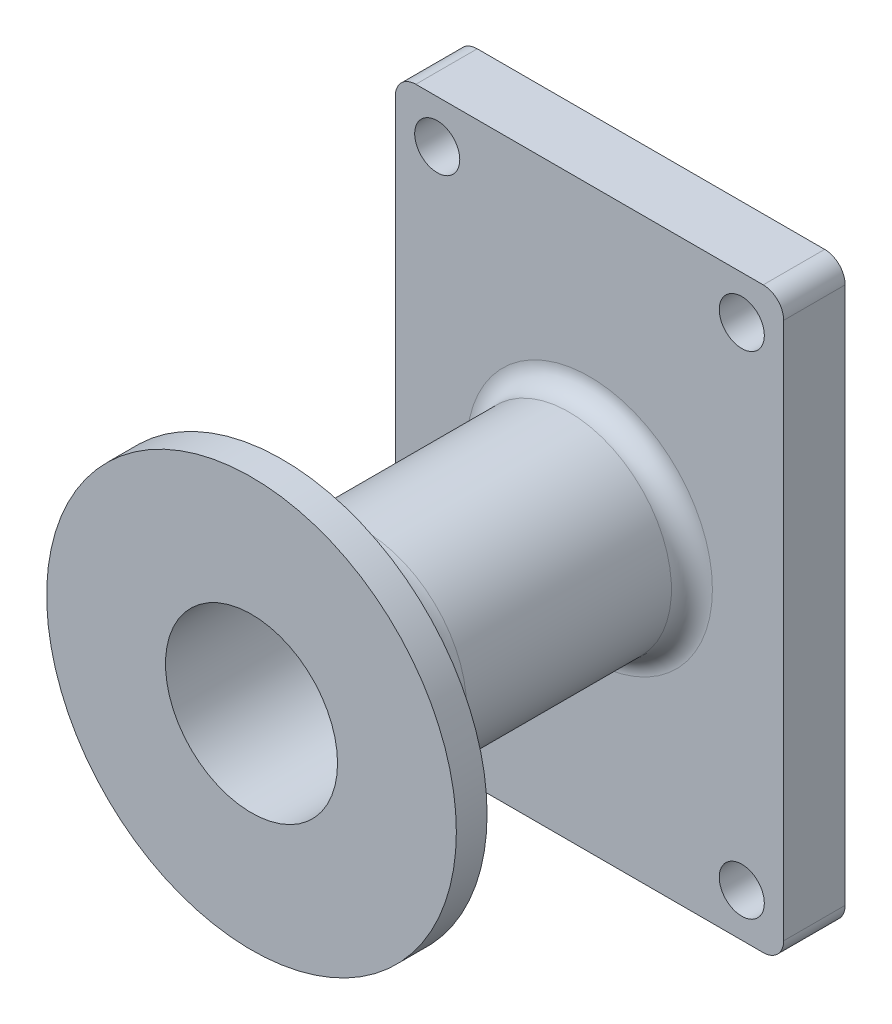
from build123d import *

# Parameters (mm, degrees)
SKETCH1_R           = 1.1
SKETCH1_R_2         = 4.2
BOSS_EXTRUDE1_DEPTH = 3
SKETCH2_R           = 5
SKETCH2_R_2         = 4.2
BOSS_EXTRUDE2_DEPTH = 15
SKETCH3_R           = 7
SKETCH3_R_2         = 4.2
BOSS_EXTRUDE3_DEPTH = 1.5
BOSS_EXTRUDE4_START = -1.5
SKETCH5_R           = 10
SKETCH5_R_2         = 4.2
BOSS_EXTRUDE4_DEPTH = 1.5
FILLET2_R           = 4
FILLET3_R           = 1


with BuildPart() as part:
    # Sketch1 → Boss-Extrude1 (new body)
    with BuildSketch(Plane.XY):
        with BuildLine():
            Line((-235.822109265, -297.144190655), (-218.862203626, -297.144190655))
            ThreePointArc((-218.862203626, -297.144190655), (-218.155096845, -296.851297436), (-217.862203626, -296.144190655))
            Line((-217.862203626, -296.144190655), (-217.862203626, -269.913133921))
            ThreePointArc((-217.862203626, -269.913133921), (-218.155096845, -269.20602714), (-218.862203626, -268.913133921))
            Line((-218.862203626, -268.913133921), (-235.822109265, -268.913133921))
            ThreePointArc((-235.822109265, -268.913133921), (-236.529216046, -269.20602714), (-236.822109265, -269.913133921))
            Line((-236.822109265, -269.913133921), (-236.822109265, -296.144190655))
            ThreePointArc((-236.822109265, -296.144190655), (-236.529216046, -296.851297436), (-235.822109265, -297.144190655))
        make_face()
        with Locations((-219.908436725, -271.028662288)):
            Circle(SKETCH1_R, mode=Mode.SUBTRACT)
        with Locations((-219.908436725, -295.028662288)):
            Circle(SKETCH1_R, mode=Mode.SUBTRACT)
        with Locations((-234.775876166, -295.028662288)):
            Circle(SKETCH1_R, mode=Mode.SUBTRACT)
        with Locations((-234.775876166, -271.028662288)):
            Circle(SKETCH1_R, mode=Mode.SUBTRACT)
        with Locations((-227.342156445, -283.028662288)):
            Circle(SKETCH1_R_2, mode=Mode.SUBTRACT)
    extrude(amount=BOSS_EXTRUDE1_DEPTH)

    # Sketch2 → Boss-Extrude2 (add)
    with BuildSketch(Plane.XY.offset(3)):
        with Locations(Location((-227.342156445, -283.028662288, 0), (0, 0, 180))):
            Circle(SKETCH2_R)
        with Locations((-227.342156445, -283.028662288)):
            Circle(SKETCH2_R_2, mode=Mode.SUBTRACT)
    extrude(amount=BOSS_EXTRUDE2_DEPTH)

    # Sketch3 → Boss-Extrude3 (add)
    with BuildSketch(Plane.XY.offset(18)):
        with Locations((-227.342156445, -283.028662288)):
            Circle(SKETCH3_R)
        with Locations((-227.342156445, -283.028662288)):
            Circle(SKETCH3_R_2, mode=Mode.SUBTRACT)
    extrude(amount=BOSS_EXTRUDE3_DEPTH)

    # Sketch5 → Boss-Extrude4 (add)
    with BuildSketch(Plane.XY.offset(19.5).offset(BOSS_EXTRUDE4_START)):
        with Locations((-227.342156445, -283.028662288)):
            Circle(SKETCH5_R)
        with Locations((-227.342156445, -283.028662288)):
            Circle(SKETCH5_R_2, mode=Mode.SUBTRACT)
    extrude(amount=BOSS_EXTRUDE4_DEPTH)

    # Fillet2
    fillet2_edges = [part.edges().sort_by_distance(p)[0] for p in [
        (-222.342156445, -283.028662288, 18),
    ]]
    fillet(fillet2_edges, radius=FILLET2_R)

    # Fillet3
    fillet3_edges = [part.edges().sort_by_distance(p)[0] for p in [
        (-222.342156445, -283.028662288, 3),
    ]]
    fillet(fillet3_edges, radius=FILLET3_R)


solid = part.part
